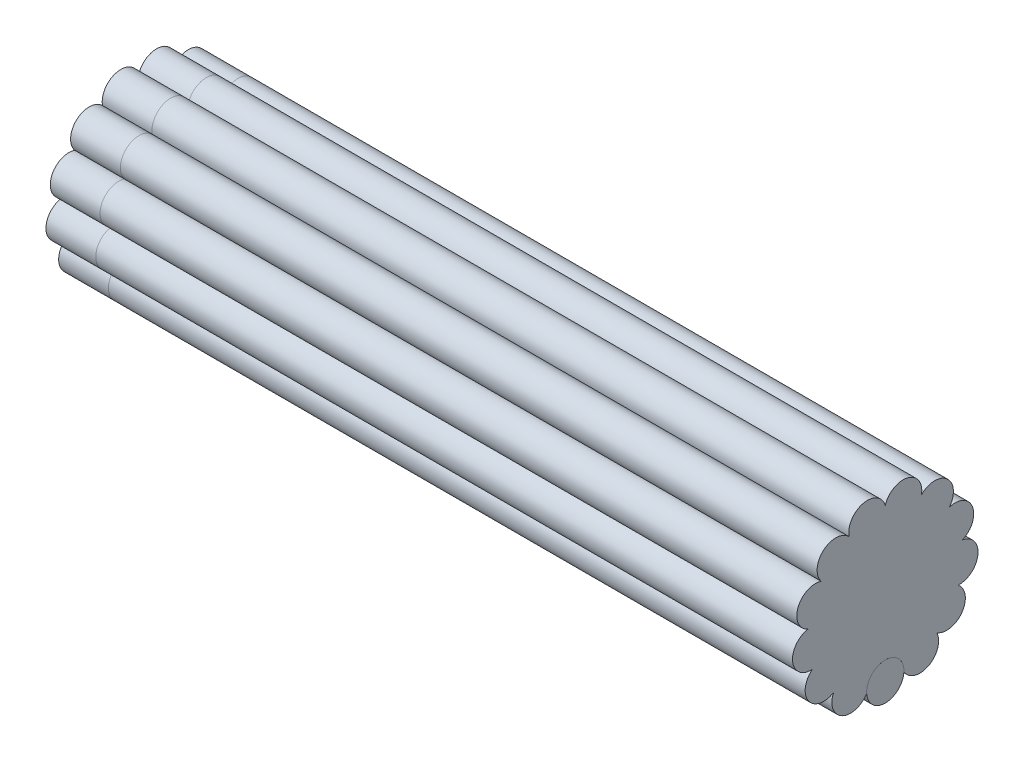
ISO-10303-21;
HEADER;
FILE_DESCRIPTION(('STEP AP214'),'2;1');
FILE_NAME('part.step','',(''),(''),'','','');
FILE_SCHEMA(('AUTOMOTIVE_DESIGN { 1 0 10303 214 1 1 1 1 }'));
ENDSEC;
DATA;
#1=APPLICATION_CONTEXT('core data for automotive mechanical design processes');
#2=APPLICATION_PROTOCOL_DEFINITION('international standard','automotive_design',2000,#1);
#3=PRODUCT_CONTEXT('',#1,'mechanical');
#4=PRODUCT('Part','Part','',(#3));
#5=PRODUCT_RELATED_PRODUCT_CATEGORY('part','',(#4));
#6=PRODUCT_DEFINITION_FORMATION('','',#4);
#7=PRODUCT_DEFINITION_CONTEXT('part definition',#1,'design');
#8=PRODUCT_DEFINITION('design','',#6,#7);
#9=PRODUCT_DEFINITION_SHAPE('','',#8);
#10=(LENGTH_UNIT() NAMED_UNIT(*) SI_UNIT(.MILLI.,.METRE.));
#11=(NAMED_UNIT(*) PLANE_ANGLE_UNIT() SI_UNIT($,.RADIAN.));
#12=(NAMED_UNIT(*) SI_UNIT($,.STERADIAN.) SOLID_ANGLE_UNIT());
#13=UNCERTAINTY_MEASURE_WITH_UNIT(LENGTH_MEASURE(1.E-05),#10,'distance_accuracy_value','');
#14=(GEOMETRIC_REPRESENTATION_CONTEXT(3) GLOBAL_UNCERTAINTY_ASSIGNED_CONTEXT((#13)) GLOBAL_UNIT_ASSIGNED_CONTEXT((#10,
#11,#12)) REPRESENTATION_CONTEXT('',''));
#15=CARTESIAN_POINT('',(0.,0.,0.));
#16=DIRECTION('',(0.,0.,1.));
#17=DIRECTION('',(1.,0.,0.));
#18=AXIS2_PLACEMENT_3D('',#15,#16,#17);
#19=CARTESIAN_POINT('',(-300.,-26.5636807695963,13.9416951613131));
#20=DIRECTION('',(1.,0.,0.));
#21=DIRECTION('',(0.,0.,-1.));
#22=AXIS2_PLACEMENT_3D('',#19,#20,#21);
#23=CYLINDRICAL_SURFACE('',#22,7.50000000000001);
#24=CARTESIAN_POINT('',(-280.,-26.5636807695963,13.9416951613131));
#25=DIRECTION('',(-1.,0.,0.));
#26=DIRECTION('',(0.,0.,1.));
#27=AXIS2_PLACEMENT_3D('',#24,#25,#26);
#28=CIRCLE('',#27,7.50000000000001);
#29=CARTESIAN_POINT('',(-280.,-30.3879587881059,7.48995914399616));
#30=VERTEX_POINT('',#29);
#31=CARTESIAN_POINT('',(-280.,-23.4264436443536,20.7540180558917));
#32=VERTEX_POINT('',#31);
#33=EDGE_CURVE('E168',#30,#32,#28,.T.);
#34=ORIENTED_EDGE('',*,*,#33,.T.);
#35=DIRECTION('',(1.,0.,0.));
#36=VECTOR('',#35,1.);
#37=CARTESIAN_POINT('',(-300.,-23.4264436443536,20.7540180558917));
#38=LINE('',#37,#36);
#39=CARTESIAN_POINT('',(-300.,-23.4264436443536,20.7540180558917));
#40=VERTEX_POINT('',#39);
#41=EDGE_CURVE('E12',#40,#32,#38,.T.);
#42=ORIENTED_EDGE('',*,*,#41,.F.);
#43=CARTESIAN_POINT('',(-300.,-26.5636807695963,13.9416951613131));
#44=DIRECTION('',(-1.,0.,0.));
#45=DIRECTION('',(0.,0.,1.));
#46=AXIS2_PLACEMENT_3D('',#43,#44,#45);
#47=CIRCLE('',#46,7.50000000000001);
#48=CARTESIAN_POINT('',(-300.,-30.3879587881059,7.48995914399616));
#49=VERTEX_POINT('',#48);
#50=EDGE_CURVE('E192',#49,#40,#47,.T.);
#51=ORIENTED_EDGE('',*,*,#50,.F.);
#52=DIRECTION('',(1.,0.,0.));
#53=VECTOR('',#52,1.);
#54=CARTESIAN_POINT('',(-300.,-30.3879587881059,7.48995914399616));
#55=LINE('',#54,#53);
#56=EDGE_CURVE('E164',#49,#30,#55,.T.);
#57=ORIENTED_EDGE('',*,*,#56,.T.);
#58=EDGE_LOOP('',(#34,#42,#51,#57));
#59=FACE_BOUND('',#58,.T.);
#60=ADVANCED_FACE('F42',(#59),#23,.T.);
#61=CARTESIAN_POINT('',(-300.,-17.0419424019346,24.6895159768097));
#62=DIRECTION('',(1.,0.,0.));
#63=DIRECTION('',(0.,0.,-1.));
#64=AXIS2_PLACEMENT_3D('',#61,#62,#63);
#65=CYLINDRICAL_SURFACE('',#64,7.50000000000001);
#66=CARTESIAN_POINT('',(-280.,-17.0419424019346,24.6895159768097));
#67=DIRECTION('',(-1.,0.,0.));
#68=DIRECTION('',(0.,0.,1.));
#69=AXIS2_PLACEMENT_3D('',#66,#67,#68);
#70=CIRCLE('',#69,7.50000000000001);
#71=CARTESIAN_POINT('',(-280.,-11.0982125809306,29.2635815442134));
#72=VERTEX_POINT('',#71);
#73=EDGE_CURVE('E171',#32,#72,#70,.T.);
#74=ORIENTED_EDGE('',*,*,#73,.T.);
#75=DIRECTION('',(1.,0.,0.));
#76=VECTOR('',#75,1.);
#77=CARTESIAN_POINT('',(-300.,-11.0982125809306,29.2635815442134));
#78=LINE('',#77,#76);
#79=CARTESIAN_POINT('',(-300.,-11.0982125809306,29.2635815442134));
#80=VERTEX_POINT('',#79);
#81=EDGE_CURVE('E50',#80,#72,#78,.T.);
#82=ORIENTED_EDGE('',*,*,#81,.F.);
#83=CARTESIAN_POINT('',(-300.,-17.0419424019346,24.6895159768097));
#84=DIRECTION('',(-1.,0.,0.));
#85=DIRECTION('',(0.,0.,1.));
#86=AXIS2_PLACEMENT_3D('',#83,#84,#85);
#87=CIRCLE('',#86,7.50000000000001);
#88=EDGE_CURVE('E116',#40,#80,#87,.T.);
#89=ORIENTED_EDGE('',*,*,#88,.F.);
#90=ORIENTED_EDGE('',*,*,#41,.T.);
#91=EDGE_LOOP('',(#74,#82,#89,#90));
#92=FACE_BOUND('',#91,.T.);
#93=ADVANCED_FACE('F275',(#92),#65,.T.);
#94=CARTESIAN_POINT('',(-300.,-3.61610040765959,29.7812662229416));
#95=DIRECTION('',(1.,0.,0.));
#96=DIRECTION('',(0.,0.,-1.));
#97=AXIS2_PLACEMENT_3D('',#94,#95,#96);
#98=CYLINDRICAL_SURFACE('',#97,7.50000000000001);
#99=CARTESIAN_POINT('',(-280.,-3.61610040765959,29.7812662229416));
#100=DIRECTION('',(-1.,0.,0.));
#101=DIRECTION('',(0.,0.,1.));
#102=AXIS2_PLACEMENT_3D('',#99,#100,#101);
#103=CIRCLE('',#102,7.50000000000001);
#104=CARTESIAN_POINT('',(-280.,3.77248523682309,31.0692111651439));
#105=VERTEX_POINT('',#104);
#106=EDGE_CURVE('E173',#72,#105,#103,.T.);
#107=ORIENTED_EDGE('',*,*,#106,.T.);
#108=DIRECTION('',(1.,0.,0.));
#109=VECTOR('',#108,1.);
#110=CARTESIAN_POINT('',(-300.,3.77248523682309,31.0692111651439));
#111=LINE('',#110,#109);
#112=CARTESIAN_POINT('',(-300.,3.77248523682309,31.0692111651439));
#113=VERTEX_POINT('',#112);
#114=EDGE_CURVE('E214',#113,#105,#111,.T.);
#115=ORIENTED_EDGE('',*,*,#114,.F.);
#116=CARTESIAN_POINT('',(-300.,-3.61610040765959,29.7812662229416));
#117=DIRECTION('',(-1.,0.,0.));
#118=DIRECTION('',(0.,0.,1.));
#119=AXIS2_PLACEMENT_3D('',#116,#117,#118);
#120=CIRCLE('',#119,7.50000000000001);
#121=EDGE_CURVE('E222',#80,#113,#120,.T.);
#122=ORIENTED_EDGE('',*,*,#121,.F.);
#123=ORIENTED_EDGE('',*,*,#81,.T.);
#124=EDGE_LOOP('',(#107,#115,#122,#123));
#125=FACE_BOUND('',#124,.T.);
#126=ADVANCED_FACE('F220',(#125),#98,.T.);
#127=CARTESIAN_POINT('',(-300.,10.6381466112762,28.0504872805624));
#128=DIRECTION('',(1.,0.,0.));
#129=DIRECTION('',(0.,0.,-1.));
#130=AXIS2_PLACEMENT_3D('',#127,#128,#129);
#131=CYLINDRICAL_SURFACE('',#130,7.50000000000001);
#132=CARTESIAN_POINT('',(-280.,10.6381466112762,28.0504872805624));
#133=DIRECTION('',(-1.,0.,0.));
#134=DIRECTION('',(0.,0.,1.));
#135=AXIS2_PLACEMENT_3D('',#132,#133,#134);
#136=CIRCLE('',#135,7.50000000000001);
#137=CARTESIAN_POINT('',(-280.,17.7789521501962,25.7572589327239));
#138=VERTEX_POINT('',#137);
#139=EDGE_CURVE('E175',#105,#138,#136,.T.);
#140=ORIENTED_EDGE('',*,*,#139,.T.);
#141=DIRECTION('',(1.,0.,0.));
#142=VECTOR('',#141,1.);
#143=CARTESIAN_POINT('',(-300.,17.7789521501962,25.7572589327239));
#144=LINE('',#143,#142);
#145=CARTESIAN_POINT('',(-300.,17.7789521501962,25.7572589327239));
#146=VERTEX_POINT('',#145);
#147=EDGE_CURVE('E211',#146,#138,#144,.T.);
#148=ORIENTED_EDGE('',*,*,#147,.F.);
#149=CARTESIAN_POINT('',(-300.,10.6381466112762,28.0504872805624));
#150=DIRECTION('',(-1.,0.,0.));
#151=DIRECTION('',(0.,0.,1.));
#152=AXIS2_PLACEMENT_3D('',#149,#150,#151);
#153=CIRCLE('',#152,7.50000000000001);
#154=EDGE_CURVE('E240',#113,#146,#153,.T.);
#155=ORIENTED_EDGE('',*,*,#154,.F.);
#156=ORIENTED_EDGE('',*,*,#114,.T.);
#157=EDGE_LOOP('',(#140,#148,#155,#156));
#158=FACE_BOUND('',#157,.T.);
#159=ADVANCED_FACE('F231',(#158),#131,.T.);
#160=CARTESIAN_POINT('',(-300.,22.4553224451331,19.8936797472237));
#161=DIRECTION('',(1.,0.,0.));
#162=DIRECTION('',(0.,0.,-1.));
#163=AXIS2_PLACEMENT_3D('',#160,#161,#162);
#164=CYLINDRICAL_SURFACE('',#163,7.50000000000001);
#165=CARTESIAN_POINT('',(-280.,22.4553224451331,19.8936797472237));
#166=DIRECTION('',(-1.,0.,0.));
#167=DIRECTION('',(0.,0.,1.));
#168=AXIS2_PLACEMENT_3D('',#165,#166,#167);
#169=CIRCLE('',#168,7.50000000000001);
#170=CARTESIAN_POINT('',(-280.,27.7124753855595,14.5446290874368));
#171=VERTEX_POINT('',#170);
#172=EDGE_CURVE('E177',#138,#171,#169,.T.);
#173=ORIENTED_EDGE('',*,*,#172,.T.);
#174=DIRECTION('',(1.,0.,0.));
#175=VECTOR('',#174,1.);
#176=CARTESIAN_POINT('',(-300.,27.7124753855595,14.5446290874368));
#177=LINE('',#176,#175);
#178=CARTESIAN_POINT('',(-300.,27.7124753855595,14.5446290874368));
#179=VERTEX_POINT('',#178);
#180=EDGE_CURVE('E208',#179,#171,#177,.T.);
#181=ORIENTED_EDGE('',*,*,#180,.F.);
#182=CARTESIAN_POINT('',(-300.,22.4553224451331,19.8936797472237));
#183=DIRECTION('',(-1.,0.,0.));
#184=DIRECTION('',(0.,0.,1.));
#185=AXIS2_PLACEMENT_3D('',#182,#183,#184);
#186=CIRCLE('',#185,7.50000000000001);
#187=EDGE_CURVE('E237',#146,#179,#186,.T.);
#188=ORIENTED_EDGE('',*,*,#187,.F.);
#189=ORIENTED_EDGE('',*,*,#147,.T.);
#190=EDGE_LOOP('',(#173,#181,#188,#189));
#191=FACE_BOUND('',#190,.T.);
#192=ADVANCED_FACE('F235',(#191),#164,.T.);
#193=CARTESIAN_POINT('',(-300.,29.1282545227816,7.17946992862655));
#194=DIRECTION('',(1.,0.,0.));
#195=DIRECTION('',(0.,0.,-1.));
#196=AXIS2_PLACEMENT_3D('',#193,#194,#195);
#197=CYLINDRICAL_SURFACE('',#196,7.5);
#198=CARTESIAN_POINT('',(-280.,29.1282545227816,7.17946992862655));
#199=DIRECTION('',(-1.,0.,0.));
#200=DIRECTION('',(0.,0.,1.));
#201=AXIS2_PLACEMENT_3D('',#198,#199,#200);
#202=CIRCLE('',#201,7.5);
#203=CARTESIAN_POINT('',(-280.,31.2974044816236,-2.15105711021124E-13));
#204=VERTEX_POINT('',#203);
#205=EDGE_CURVE('E179',#171,#204,#202,.T.);
#206=ORIENTED_EDGE('',*,*,#205,.T.);
#207=DIRECTION('',(1.,0.,0.));
#208=VECTOR('',#207,1.);
#209=CARTESIAN_POINT('',(-300.,31.2974044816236,-2.15105711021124E-13));
#210=LINE('',#209,#208);
#211=CARTESIAN_POINT('',(-300.,31.2974044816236,-2.15105711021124E-13));
#212=VERTEX_POINT('',#211);
#213=EDGE_CURVE('E205',#212,#204,#210,.T.);
#214=ORIENTED_EDGE('',*,*,#213,.F.);
#215=CARTESIAN_POINT('',(-300.,29.1282545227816,7.17946992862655));
#216=DIRECTION('',(-1.,0.,0.));
#217=DIRECTION('',(0.,0.,1.));
#218=AXIS2_PLACEMENT_3D('',#215,#216,#217);
#219=CIRCLE('',#218,7.5);
#220=EDGE_CURVE('E239',#179,#212,#219,.T.);
#221=ORIENTED_EDGE('',*,*,#220,.F.);
#222=ORIENTED_EDGE('',*,*,#180,.T.);
#223=EDGE_LOOP('',(#206,#214,#221,#222));
#224=FACE_BOUND('',#223,.T.);
#225=ADVANCED_FACE('F288',(#224),#197,.T.);
#226=CARTESIAN_POINT('',(-300.,29.1282545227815,-7.17946992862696));
#227=DIRECTION('',(1.,0.,0.));
#228=DIRECTION('',(0.,0.,-1.));
#229=AXIS2_PLACEMENT_3D('',#226,#227,#228);
#230=CYLINDRICAL_SURFACE('',#229,7.50000000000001);
#231=CARTESIAN_POINT('',(-280.,29.1282545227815,-7.17946992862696));
#232=DIRECTION('',(-1.,0.,0.));
#233=DIRECTION('',(0.,0.,1.));
#234=AXIS2_PLACEMENT_3D('',#231,#232,#233);
#235=CIRCLE('',#234,7.50000000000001);
#236=CARTESIAN_POINT('',(-280.,27.7124753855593,-14.5446290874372));
#237=VERTEX_POINT('',#236);
#238=EDGE_CURVE('E181',#204,#237,#235,.T.);
#239=ORIENTED_EDGE('',*,*,#238,.T.);
#240=DIRECTION('',(1.,0.,0.));
#241=VECTOR('',#240,1.);
#242=CARTESIAN_POINT('',(-300.,27.7124753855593,-14.5446290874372));
#243=LINE('',#242,#241);
#244=CARTESIAN_POINT('',(-300.,27.7124753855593,-14.5446290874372));
#245=VERTEX_POINT('',#244);
#246=EDGE_CURVE('E202',#245,#237,#243,.T.);
#247=ORIENTED_EDGE('',*,*,#246,.F.);
#248=CARTESIAN_POINT('',(-300.,29.1282545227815,-7.17946992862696));
#249=DIRECTION('',(-1.,0.,0.));
#250=DIRECTION('',(0.,0.,1.));
#251=AXIS2_PLACEMENT_3D('',#248,#249,#250);
#252=CIRCLE('',#251,7.50000000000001);
#253=EDGE_CURVE('E242',#212,#245,#252,.T.);
#254=ORIENTED_EDGE('',*,*,#253,.F.);
#255=ORIENTED_EDGE('',*,*,#213,.T.);
#256=EDGE_LOOP('',(#239,#247,#254,#255));
#257=FACE_BOUND('',#256,.T.);
#258=ADVANCED_FACE('F291',(#257),#230,.T.);
#259=CARTESIAN_POINT('',(-300.,22.4553224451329,-19.893679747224));
#260=DIRECTION('',(1.,0.,0.));
#261=DIRECTION('',(0.,0.,-1.));
#262=AXIS2_PLACEMENT_3D('',#259,#260,#261);
#263=CYLINDRICAL_SURFACE('',#262,7.50000000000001);
#264=CARTESIAN_POINT('',(-280.,22.4553224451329,-19.893679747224));
#265=DIRECTION('',(-1.,0.,0.));
#266=DIRECTION('',(0.,0.,1.));
#267=AXIS2_PLACEMENT_3D('',#264,#265,#266);
#268=CIRCLE('',#267,7.50000000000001);
#269=CARTESIAN_POINT('',(-280.,17.7789521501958,-25.7572589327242));
#270=VERTEX_POINT('',#269);
#271=EDGE_CURVE('E183',#237,#270,#268,.T.);
#272=ORIENTED_EDGE('',*,*,#271,.T.);
#273=DIRECTION('',(1.,0.,0.));
#274=VECTOR('',#273,1.);
#275=CARTESIAN_POINT('',(-300.,17.7789521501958,-25.7572589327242));
#276=LINE('',#275,#274);
#277=CARTESIAN_POINT('',(-300.,17.7789521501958,-25.7572589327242));
#278=VERTEX_POINT('',#277);
#279=EDGE_CURVE('E199',#278,#270,#276,.T.);
#280=ORIENTED_EDGE('',*,*,#279,.F.);
#281=CARTESIAN_POINT('',(-300.,22.4553224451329,-19.893679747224));
#282=DIRECTION('',(-1.,0.,0.));
#283=DIRECTION('',(0.,0.,1.));
#284=AXIS2_PLACEMENT_3D('',#281,#282,#283);
#285=CIRCLE('',#284,7.50000000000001);
#286=EDGE_CURVE('E248',#245,#278,#285,.T.);
#287=ORIENTED_EDGE('',*,*,#286,.F.);
#288=ORIENTED_EDGE('',*,*,#246,.T.);
#289=EDGE_LOOP('',(#272,#280,#287,#288));
#290=FACE_BOUND('',#289,.T.);
#291=ADVANCED_FACE('F295',(#290),#263,.T.);
#292=CARTESIAN_POINT('',(-300.,10.6381466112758,-28.0504872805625));
#293=DIRECTION('',(1.,0.,0.));
#294=DIRECTION('',(0.,0.,-1.));
#295=AXIS2_PLACEMENT_3D('',#292,#293,#294);
#296=CYLINDRICAL_SURFACE('',#295,7.49999999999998);
#297=CARTESIAN_POINT('',(-280.,10.6381466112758,-28.0504872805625));
#298=DIRECTION('',(-1.,0.,0.));
#299=DIRECTION('',(0.,0.,1.));
#300=AXIS2_PLACEMENT_3D('',#297,#298,#299);
#301=CIRCLE('',#300,7.49999999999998);
#302=CARTESIAN_POINT('',(-280.,3.77248523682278,-31.069211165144));
#303=VERTEX_POINT('',#302);
#304=EDGE_CURVE('E185',#270,#303,#301,.T.);
#305=ORIENTED_EDGE('',*,*,#304,.T.);
#306=DIRECTION('',(1.,0.,0.));
#307=VECTOR('',#306,1.);
#308=CARTESIAN_POINT('',(-300.,3.77248523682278,-31.069211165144));
#309=LINE('',#308,#307);
#310=CARTESIAN_POINT('',(-300.,3.77248523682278,-31.069211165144));
#311=VERTEX_POINT('',#310);
#312=EDGE_CURVE('E196',#311,#303,#309,.T.);
#313=ORIENTED_EDGE('',*,*,#312,.F.);
#314=CARTESIAN_POINT('',(-300.,10.6381466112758,-28.0504872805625));
#315=DIRECTION('',(-1.,0.,0.));
#316=DIRECTION('',(0.,0.,1.));
#317=AXIS2_PLACEMENT_3D('',#314,#315,#316);
#318=CIRCLE('',#317,7.49999999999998);
#319=EDGE_CURVE('E250',#278,#311,#318,.T.);
#320=ORIENTED_EDGE('',*,*,#319,.F.);
#321=ORIENTED_EDGE('',*,*,#279,.T.);
#322=EDGE_LOOP('',(#305,#313,#320,#321));
#323=FACE_BOUND('',#322,.T.);
#324=ADVANCED_FACE('F256',(#323),#296,.T.);
#325=CARTESIAN_POINT('',(-300.,-3.61610040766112,-29.7812662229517));
#326=DIRECTION('',(1.,0.,0.));
#327=DIRECTION('',(0.,0.,-1.));
#328=AXIS2_PLACEMENT_3D('',#325,#326,#327);
#329=CYLINDRICAL_SURFACE('',#328,7.49999999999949);
#330=CARTESIAN_POINT('',(-280.,-3.61610040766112,-29.7812662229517));
#331=DIRECTION('',(-1.,0.,0.));
#332=DIRECTION('',(0.,0.,1.));
#333=AXIS2_PLACEMENT_3D('',#330,#331,#332);
#334=CIRCLE('',#333,7.49999999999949);
#335=CARTESIAN_POINT('',(-280.,-11.098212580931,-29.2635815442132));
#336=VERTEX_POINT('',#335);
#337=EDGE_CURVE('E187',#303,#336,#334,.T.);
#338=ORIENTED_EDGE('',*,*,#337,.T.);
#339=DIRECTION('',(1.,0.,0.));
#340=VECTOR('',#339,1.);
#341=CARTESIAN_POINT('',(-300.,-11.098212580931,-29.2635815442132));
#342=LINE('',#341,#340);
#343=CARTESIAN_POINT('',(-300.,-11.098212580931,-29.2635815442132));
#344=VERTEX_POINT('',#343);
#345=EDGE_CURVE('E159',#344,#336,#342,.T.);
#346=ORIENTED_EDGE('',*,*,#345,.F.);
#347=CARTESIAN_POINT('',(-300.,-3.61610040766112,-29.7812662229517));
#348=DIRECTION('',(-1.,0.,0.));
#349=DIRECTION('',(0.,0.,1.));
#350=AXIS2_PLACEMENT_3D('',#347,#348,#349);
#351=CIRCLE('',#350,7.49999999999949);
#352=EDGE_CURVE('E150',#311,#344,#351,.T.);
#353=ORIENTED_EDGE('',*,*,#352,.F.);
#354=ORIENTED_EDGE('',*,*,#312,.T.);
#355=EDGE_LOOP('',(#338,#346,#353,#354));
#356=FACE_BOUND('',#355,.T.);
#357=ADVANCED_FACE('F260',(#356),#329,.T.);
#358=CARTESIAN_POINT('',(-300.,-17.041942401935,-24.6895159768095));
#359=DIRECTION('',(1.,0.,0.));
#360=DIRECTION('',(0.,0.,-1.));
#361=AXIS2_PLACEMENT_3D('',#358,#359,#360);
#362=CYLINDRICAL_SURFACE('',#361,7.50000000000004);
#363=CARTESIAN_POINT('',(-280.,-17.041942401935,-24.6895159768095));
#364=DIRECTION('',(-1.,0.,0.));
#365=DIRECTION('',(0.,0.,1.));
#366=AXIS2_PLACEMENT_3D('',#363,#364,#365);
#367=CIRCLE('',#366,7.50000000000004);
#368=CARTESIAN_POINT('',(-280.,-23.4264436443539,-20.7540180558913));
#369=VERTEX_POINT('',#368);
#370=EDGE_CURVE('E158',#336,#369,#367,.T.);
#371=ORIENTED_EDGE('',*,*,#370,.T.);
#372=DIRECTION('',(1.,0.,0.));
#373=VECTOR('',#372,1.);
#374=CARTESIAN_POINT('',(-300.,-23.4264436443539,-20.7540180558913));
#375=LINE('',#374,#373);
#376=CARTESIAN_POINT('',(-300.,-23.4264436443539,-20.7540180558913));
#377=VERTEX_POINT('',#376);
#378=EDGE_CURVE('E155',#377,#369,#375,.T.);
#379=ORIENTED_EDGE('',*,*,#378,.F.);
#380=CARTESIAN_POINT('',(-300.,-17.041942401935,-24.6895159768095));
#381=DIRECTION('',(-1.,0.,0.));
#382=DIRECTION('',(0.,0.,1.));
#383=AXIS2_PLACEMENT_3D('',#380,#381,#382);
#384=CIRCLE('',#383,7.50000000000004);
#385=EDGE_CURVE('E144',#344,#377,#384,.T.);
#386=ORIENTED_EDGE('',*,*,#385,.F.);
#387=ORIENTED_EDGE('',*,*,#345,.T.);
#388=EDGE_LOOP('',(#371,#379,#386,#387));
#389=FACE_BOUND('',#388,.T.);
#390=ADVANCED_FACE('F156',(#389),#362,.T.);
#391=CARTESIAN_POINT('',(-300.,-26.5636807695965,-13.9416951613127));
#392=DIRECTION('',(1.,0.,0.));
#393=DIRECTION('',(0.,0.,-1.));
#394=AXIS2_PLACEMENT_3D('',#391,#392,#393);
#395=CYLINDRICAL_SURFACE('',#394,7.50000000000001);
#396=CARTESIAN_POINT('',(-280.,-26.5636807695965,-13.9416951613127));
#397=DIRECTION('',(-1.,0.,0.));
#398=DIRECTION('',(0.,0.,1.));
#399=AXIS2_PLACEMENT_3D('',#396,#397,#398);
#400=CIRCLE('',#399,7.50000000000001);
#401=CARTESIAN_POINT('',(-280.,-30.3879587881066,-7.48995914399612));
#402=VERTEX_POINT('',#401);
#403=EDGE_CURVE('E102',#369,#402,#400,.T.);
#404=ORIENTED_EDGE('',*,*,#403,.T.);
#405=DIRECTION('',(1.,0.,0.));
#406=VECTOR('',#405,1.);
#407=CARTESIAN_POINT('',(-300.,-30.3879587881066,-7.48995914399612));
#408=LINE('',#407,#406);
#409=CARTESIAN_POINT('',(-300.,-30.3879587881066,-7.48995914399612));
#410=VERTEX_POINT('',#409);
#411=EDGE_CURVE('E160',#410,#402,#408,.T.);
#412=ORIENTED_EDGE('',*,*,#411,.F.);
#413=CARTESIAN_POINT('',(-300.,-26.5636807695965,-13.9416951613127));
#414=DIRECTION('',(-1.,0.,0.));
#415=DIRECTION('',(0.,0.,1.));
#416=AXIS2_PLACEMENT_3D('',#413,#414,#415);
#417=CIRCLE('',#416,7.50000000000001);
#418=EDGE_CURVE('E148',#377,#410,#417,.T.);
#419=ORIENTED_EDGE('',*,*,#418,.F.);
#420=ORIENTED_EDGE('',*,*,#378,.T.);
#421=EDGE_LOOP('',(#404,#412,#419,#420));
#422=FACE_BOUND('',#421,.T.);
#423=ADVANCED_FACE('F162',(#422),#395,.T.);
#424=CARTESIAN_POINT('',(-300.,-30.,0.));
#425=DIRECTION('',(1.,0.,0.));
#426=DIRECTION('',(0.,0.,-1.));
#427=AXIS2_PLACEMENT_3D('',#424,#425,#426);
#428=CYLINDRICAL_SURFACE('',#427,7.50000000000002);
#429=CARTESIAN_POINT('',(-280.,-30.,0.));
#430=DIRECTION('',(-1.,0.,0.));
#431=DIRECTION('',(0.,0.,1.));
#432=AXIS2_PLACEMENT_3D('',#429,#430,#431);
#433=CIRCLE('',#432,7.50000000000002);
#434=EDGE_CURVE('E108',#402,#30,#433,.T.);
#435=ORIENTED_EDGE('',*,*,#434,.T.);
#436=ORIENTED_EDGE('',*,*,#56,.F.);
#437=CARTESIAN_POINT('',(-300.,-30.,0.));
#438=DIRECTION('',(-1.,0.,0.));
#439=DIRECTION('',(0.,0.,1.));
#440=AXIS2_PLACEMENT_3D('',#437,#438,#439);
#441=CIRCLE('',#440,7.50000000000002);
#442=EDGE_CURVE('E58',#410,#49,#441,.T.);
#443=ORIENTED_EDGE('',*,*,#442,.F.);
#444=ORIENTED_EDGE('',*,*,#411,.T.);
#445=EDGE_LOOP('',(#435,#436,#443,#444));
#446=FACE_BOUND('',#445,.T.);
#447=ADVANCED_FACE('F264',(#446),#428,.T.);
#448=CARTESIAN_POINT('',(-300.,-21.8028115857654,19.3156055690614));
#449=DIRECTION('',(-1.,0.,0.));
#450=DIRECTION('',(0.,0.,1.));
#451=AXIS2_PLACEMENT_3D('',#448,#449,#450);
#452=PLANE('',#451);
#453=ORIENTED_EDGE('',*,*,#50,.T.);
#454=ORIENTED_EDGE('',*,*,#88,.T.);
#455=ORIENTED_EDGE('',*,*,#121,.T.);
#456=ORIENTED_EDGE('',*,*,#154,.T.);
#457=ORIENTED_EDGE('',*,*,#187,.T.);
#458=ORIENTED_EDGE('',*,*,#220,.T.);
#459=ORIENTED_EDGE('',*,*,#253,.T.);
#460=ORIENTED_EDGE('',*,*,#286,.T.);
#461=ORIENTED_EDGE('',*,*,#319,.T.);
#462=ORIENTED_EDGE('',*,*,#352,.T.);
#463=ORIENTED_EDGE('',*,*,#385,.T.);
#464=ORIENTED_EDGE('',*,*,#418,.T.);
#465=ORIENTED_EDGE('',*,*,#442,.T.);
#466=EDGE_LOOP('',(#453,#454,#455,#456,#457,#458,#459,#460,#461,#462,#463,#464,#465));
#467=FACE_BOUND('',#466,.T.);
#468=ADVANCED_FACE('F146',(#467),#452,.T.);
#469=CARTESIAN_POINT('',(-280.,-21.8028115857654,19.3156055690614));
#470=DIRECTION('',(-1.,0.,0.));
#471=DIRECTION('',(0.,0.,1.));
#472=AXIS2_PLACEMENT_3D('',#469,#470,#471);
#473=PLANE('',#472);
#474=ORIENTED_EDGE('',*,*,#33,.F.);
#475=ORIENTED_EDGE('',*,*,#434,.F.);
#476=ORIENTED_EDGE('',*,*,#403,.F.);
#477=ORIENTED_EDGE('',*,*,#370,.F.);
#478=ORIENTED_EDGE('',*,*,#337,.F.);
#479=ORIENTED_EDGE('',*,*,#304,.F.);
#480=ORIENTED_EDGE('',*,*,#271,.F.);
#481=ORIENTED_EDGE('',*,*,#238,.F.);
#482=ORIENTED_EDGE('',*,*,#205,.F.);
#483=ORIENTED_EDGE('',*,*,#172,.F.);
#484=ORIENTED_EDGE('',*,*,#139,.F.);
#485=ORIENTED_EDGE('',*,*,#106,.F.);
#486=ORIENTED_EDGE('',*,*,#73,.F.);
#487=EDGE_LOOP('',(#474,#475,#476,#477,#478,#479,#480,#481,#482,#483,#484,#485,#486));
#488=FACE_BOUND('',#487,.T.);
#489=ADVANCED_FACE('F226',(#488),#473,.F.);
#490=CLOSED_SHELL('',(#60,#93,#126,#159,#192,#225,#258,#291,#324,#357,#390,#423,#447,#468,#489));
#491=MANIFOLD_SOLID_BREP('B2',#490);
#492=CARTESIAN_POINT('',(-280.,-30.,0.));
#493=DIRECTION('',(1.,0.,0.));
#494=DIRECTION('',(0.,0.,-1.));
#495=AXIS2_PLACEMENT_3D('',#492,#493,#494);
#496=CYLINDRICAL_SURFACE('',#495,7.5);
#497=CARTESIAN_POINT('',(-280.,-30.,0.));
#498=DIRECTION('',(1.,0.,0.));
#499=DIRECTION('',(0.,0.,-1.));
#500=AXIS2_PLACEMENT_3D('',#497,#498,#499);
#501=CIRCLE('',#500,7.5);
#502=CARTESIAN_POINT('',(-280.,-30.,-7.5));
#503=VERTEX_POINT('',#502);
#504=EDGE_CURVE('E41',#503,#503,#501,.T.);
#505=ORIENTED_EDGE('',*,*,#504,.T.);
#506=EDGE_LOOP('',(#505));
#507=FACE_BOUND('',#506,.T.);
#508=CARTESIAN_POINT('',(0.,-30.,0.));
#509=DIRECTION('',(1.,0.,0.));
#510=DIRECTION('',(0.,0.,-1.));
#511=AXIS2_PLACEMENT_3D('',#508,#509,#510);
#512=CIRCLE('',#511,7.5);
#513=CARTESIAN_POINT('',(0.,-30.,-7.5));
#514=VERTEX_POINT('',#513);
#515=EDGE_CURVE('E412',#514,#514,#512,.T.);
#516=ORIENTED_EDGE('',*,*,#515,.F.);
#517=EDGE_LOOP('',(#516));
#518=FACE_BOUND('',#517,.T.);
#519=ADVANCED_FACE('F409',(#507,#518),#496,.T.);
#520=CARTESIAN_POINT('',(-280.,-30.,0.));
#521=DIRECTION('',(1.,0.,0.));
#522=DIRECTION('',(0.,0.,-1.));
#523=AXIS2_PLACEMENT_3D('',#520,#521,#522);
#524=PLANE('',#523);
#525=ORIENTED_EDGE('',*,*,#504,.F.);
#526=EDGE_LOOP('',(#525));
#527=FACE_BOUND('',#526,.T.);
#528=ADVANCED_FACE('F424',(#527),#524,.F.);
#529=CARTESIAN_POINT('',(0.,-30.,0.));
#530=DIRECTION('',(1.,0.,0.));
#531=DIRECTION('',(0.,0.,-1.));
#532=AXIS2_PLACEMENT_3D('',#529,#530,#531);
#533=PLANE('',#532);
#534=ORIENTED_EDGE('',*,*,#515,.T.);
#535=EDGE_LOOP('',(#534));
#536=FACE_BOUND('',#535,.T.);
#537=ADVANCED_FACE('F421',(#536),#533,.T.);
#538=CLOSED_SHELL('',(#519,#528,#537));
#539=MANIFOLD_SOLID_BREP('B6',#538);
#540=CARTESIAN_POINT('',(-280.,-26.5636807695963,13.9416951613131));
#541=DIRECTION('',(1.,0.,0.));
#542=DIRECTION('',(0.,0.,-1.));
#543=AXIS2_PLACEMENT_3D('',#540,#541,#542);
#544=CYLINDRICAL_SURFACE('',#543,7.50000000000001);
#545=CARTESIAN_POINT('',(0.,-26.5636807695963,13.9416951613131));
#546=DIRECTION('',(1.,0.,0.));
#547=DIRECTION('',(0.,0.,-1.));
#548=AXIS2_PLACEMENT_3D('',#545,#546,#547);
#549=CIRCLE('',#548,7.50000000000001);
#550=CARTESIAN_POINT('',(0.,-23.4264436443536,20.7540180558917));
#551=VERTEX_POINT('',#550);
#552=CARTESIAN_POINT('',(0.,-30.3879587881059,7.48995914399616));
#553=VERTEX_POINT('',#552);
#554=EDGE_CURVE('E577',#551,#553,#549,.T.);
#555=ORIENTED_EDGE('',*,*,#554,.F.);
#556=DIRECTION('',(1.,0.,0.));
#557=VECTOR('',#556,1.);
#558=CARTESIAN_POINT('',(-280.,-23.4264436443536,20.7540180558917));
#559=LINE('',#558,#557);
#560=CARTESIAN_POINT('',(-280.,-23.4264436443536,20.7540180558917));
#561=VERTEX_POINT('',#560);
#562=EDGE_CURVE('E407',#561,#551,#559,.T.);
#563=ORIENTED_EDGE('',*,*,#562,.F.);
#564=CARTESIAN_POINT('',(-280.,-26.5636807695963,13.9416951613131));
#565=DIRECTION('',(1.,0.,0.));
#566=DIRECTION('',(0.,0.,-1.));
#567=AXIS2_PLACEMENT_3D('',#564,#565,#566);
#568=CIRCLE('',#567,7.50000000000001);
#569=CARTESIAN_POINT('',(-280.,-30.3879587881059,7.48995914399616));
#570=VERTEX_POINT('',#569);
#571=EDGE_CURVE('E612',#561,#570,#568,.T.);
#572=ORIENTED_EDGE('',*,*,#571,.T.);
#573=DIRECTION('',(1.,0.,0.));
#574=VECTOR('',#573,1.);
#575=CARTESIAN_POINT('',(-280.,-30.3879587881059,7.48995914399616));
#576=LINE('',#575,#574);
#577=EDGE_CURVE('E453',#570,#553,#576,.T.);
#578=ORIENTED_EDGE('',*,*,#577,.T.);
#579=EDGE_LOOP('',(#555,#563,#572,#578));
#580=FACE_BOUND('',#579,.T.);
#581=ADVANCED_FACE('F450',(#580),#544,.T.);
#582=CARTESIAN_POINT('',(-280.,-17.0419424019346,24.6895159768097));
#583=DIRECTION('',(1.,0.,0.));
#584=DIRECTION('',(0.,0.,-1.));
#585=AXIS2_PLACEMENT_3D('',#582,#583,#584);
#586=CYLINDRICAL_SURFACE('',#585,7.50000000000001);
#587=CARTESIAN_POINT('',(0.,-17.0419424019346,24.6895159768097));
#588=DIRECTION('',(1.,0.,0.));
#589=DIRECTION('',(0.,0.,-1.));
#590=AXIS2_PLACEMENT_3D('',#587,#588,#589);
#591=CIRCLE('',#590,7.50000000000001);
#592=CARTESIAN_POINT('',(0.,-11.0982125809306,29.2635815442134));
#593=VERTEX_POINT('',#592);
#594=EDGE_CURVE('E610',#593,#551,#591,.T.);
#595=ORIENTED_EDGE('',*,*,#594,.F.);
#596=DIRECTION('',(1.,0.,0.));
#597=VECTOR('',#596,1.);
#598=CARTESIAN_POINT('',(-280.,-11.0982125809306,29.2635815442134));
#599=LINE('',#598,#597);
#600=CARTESIAN_POINT('',(-280.,-11.0982125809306,29.2635815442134));
#601=VERTEX_POINT('',#600);
#602=EDGE_CURVE('E459',#601,#593,#599,.T.);
#603=ORIENTED_EDGE('',*,*,#602,.F.);
#604=CARTESIAN_POINT('',(-280.,-17.0419424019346,24.6895159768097));
#605=DIRECTION('',(1.,0.,0.));
#606=DIRECTION('',(0.,0.,-1.));
#607=AXIS2_PLACEMENT_3D('',#604,#605,#606);
#608=CIRCLE('',#607,7.50000000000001);
#609=EDGE_CURVE('E567',#601,#561,#608,.T.);
#610=ORIENTED_EDGE('',*,*,#609,.T.);
#611=ORIENTED_EDGE('',*,*,#562,.T.);
#612=EDGE_LOOP('',(#595,#603,#610,#611));
#613=FACE_BOUND('',#612,.T.);
#614=ADVANCED_FACE('F634',(#613),#586,.T.);
#615=CARTESIAN_POINT('',(-280.,-3.61610040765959,29.7812662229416));
#616=DIRECTION('',(1.,0.,0.));
#617=DIRECTION('',(0.,0.,-1.));
#618=AXIS2_PLACEMENT_3D('',#615,#616,#617);
#619=CYLINDRICAL_SURFACE('',#618,7.50000000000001);
#620=CARTESIAN_POINT('',(0.,-3.61610040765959,29.7812662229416));
#621=DIRECTION('',(1.,0.,0.));
#622=DIRECTION('',(0.,0.,-1.));
#623=AXIS2_PLACEMENT_3D('',#620,#621,#622);
#624=CIRCLE('',#623,7.50000000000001);
#625=CARTESIAN_POINT('',(0.,3.7724852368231,31.0692111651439));
#626=VERTEX_POINT('',#625);
#627=EDGE_CURVE('E554',#626,#593,#624,.T.);
#628=ORIENTED_EDGE('',*,*,#627,.F.);
#629=DIRECTION('',(1.,0.,0.));
#630=VECTOR('',#629,1.);
#631=CARTESIAN_POINT('',(-280.,3.7724852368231,31.0692111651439));
#632=LINE('',#631,#630);
#633=CARTESIAN_POINT('',(-280.,3.7724852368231,31.0692111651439));
#634=VERTEX_POINT('',#633);
#635=EDGE_CURVE('E549',#634,#626,#632,.T.);
#636=ORIENTED_EDGE('',*,*,#635,.F.);
#637=CARTESIAN_POINT('',(-280.,-3.61610040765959,29.7812662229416));
#638=DIRECTION('',(1.,0.,0.));
#639=DIRECTION('',(0.,0.,-1.));
#640=AXIS2_PLACEMENT_3D('',#637,#638,#639);
#641=CIRCLE('',#640,7.50000000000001);
#642=EDGE_CURVE('E552',#634,#601,#641,.T.);
#643=ORIENTED_EDGE('',*,*,#642,.T.);
#644=ORIENTED_EDGE('',*,*,#602,.T.);
#645=EDGE_LOOP('',(#628,#636,#643,#644));
#646=FACE_BOUND('',#645,.T.);
#647=ADVANCED_FACE('F551',(#646),#619,.T.);
#648=CARTESIAN_POINT('',(-280.,10.6381466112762,28.0504872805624));
#649=DIRECTION('',(1.,0.,0.));
#650=DIRECTION('',(0.,0.,-1.));
#651=AXIS2_PLACEMENT_3D('',#648,#649,#650);
#652=CYLINDRICAL_SURFACE('',#651,7.50000000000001);
#653=CARTESIAN_POINT('',(0.,10.6381466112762,28.0504872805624));
#654=DIRECTION('',(1.,0.,0.));
#655=DIRECTION('',(0.,0.,-1.));
#656=AXIS2_PLACEMENT_3D('',#653,#654,#655);
#657=CIRCLE('',#656,7.50000000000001);
#658=CARTESIAN_POINT('',(0.,17.7789521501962,25.757258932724));
#659=VERTEX_POINT('',#658);
#660=EDGE_CURVE('E607',#659,#626,#657,.T.);
#661=ORIENTED_EDGE('',*,*,#660,.F.);
#662=DIRECTION('',(1.,0.,0.));
#663=VECTOR('',#662,1.);
#664=CARTESIAN_POINT('',(-280.,17.7789521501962,25.757258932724));
#665=LINE('',#664,#663);
#666=CARTESIAN_POINT('',(-280.,17.7789521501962,25.757258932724));
#667=VERTEX_POINT('',#666);
#668=EDGE_CURVE('E559',#667,#659,#665,.T.);
#669=ORIENTED_EDGE('',*,*,#668,.F.);
#670=CARTESIAN_POINT('',(-280.,10.6381466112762,28.0504872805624));
#671=DIRECTION('',(1.,0.,0.));
#672=DIRECTION('',(0.,0.,-1.));
#673=AXIS2_PLACEMENT_3D('',#670,#671,#672);
#674=CIRCLE('',#673,7.50000000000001);
#675=EDGE_CURVE('E565',#667,#634,#674,.T.);
#676=ORIENTED_EDGE('',*,*,#675,.T.);
#677=ORIENTED_EDGE('',*,*,#635,.T.);
#678=EDGE_LOOP('',(#661,#669,#676,#677));
#679=FACE_BOUND('',#678,.T.);
#680=ADVANCED_FACE('F569',(#679),#652,.T.);
#681=CARTESIAN_POINT('',(-280.,22.4553224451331,19.8936797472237));
#682=DIRECTION('',(1.,0.,0.));
#683=DIRECTION('',(0.,0.,-1.));
#684=AXIS2_PLACEMENT_3D('',#681,#682,#683);
#685=CYLINDRICAL_SURFACE('',#684,7.50000000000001);
#686=CARTESIAN_POINT('',(0.,22.4553224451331,19.8936797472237));
#687=DIRECTION('',(1.,0.,0.));
#688=DIRECTION('',(0.,0.,-1.));
#689=AXIS2_PLACEMENT_3D('',#686,#687,#688);
#690=CIRCLE('',#689,7.50000000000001);
#691=CARTESIAN_POINT('',(0.,27.7124753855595,14.5446290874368));
#692=VERTEX_POINT('',#691);
#693=EDGE_CURVE('E604',#692,#659,#690,.T.);
#694=ORIENTED_EDGE('',*,*,#693,.F.);
#695=DIRECTION('',(1.,0.,0.));
#696=VECTOR('',#695,1.);
#697=CARTESIAN_POINT('',(-280.,27.7124753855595,14.5446290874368));
#698=LINE('',#697,#696);
#699=CARTESIAN_POINT('',(-280.,27.7124753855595,14.5446290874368));
#700=VERTEX_POINT('',#699);
#701=EDGE_CURVE('E616',#700,#692,#698,.T.);
#702=ORIENTED_EDGE('',*,*,#701,.F.);
#703=CARTESIAN_POINT('',(-280.,22.4553224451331,19.8936797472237));
#704=DIRECTION('',(1.,0.,0.));
#705=DIRECTION('',(0.,0.,-1.));
#706=AXIS2_PLACEMENT_3D('',#703,#704,#705);
#707=CIRCLE('',#706,7.50000000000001);
#708=EDGE_CURVE('E570',#700,#667,#707,.T.);
#709=ORIENTED_EDGE('',*,*,#708,.T.);
#710=ORIENTED_EDGE('',*,*,#668,.T.);
#711=EDGE_LOOP('',(#694,#702,#709,#710));
#712=FACE_BOUND('',#711,.T.);
#713=ADVANCED_FACE('F647',(#712),#685,.T.);
#714=CARTESIAN_POINT('',(-280.,29.1282545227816,7.17946992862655));
#715=DIRECTION('',(1.,0.,0.));
#716=DIRECTION('',(0.,0.,-1.));
#717=AXIS2_PLACEMENT_3D('',#714,#715,#716);
#718=CYLINDRICAL_SURFACE('',#717,7.5);
#719=CARTESIAN_POINT('',(0.,29.1282545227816,7.17946992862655));
#720=DIRECTION('',(1.,0.,0.));
#721=DIRECTION('',(0.,0.,-1.));
#722=AXIS2_PLACEMENT_3D('',#719,#720,#721);
#723=CIRCLE('',#722,7.5);
#724=CARTESIAN_POINT('',(0.,31.2974044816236,-2.14238349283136E-13));
#725=VERTEX_POINT('',#724);
#726=EDGE_CURVE('E601',#725,#692,#723,.T.);
#727=ORIENTED_EDGE('',*,*,#726,.F.);
#728=DIRECTION('',(1.,0.,0.));
#729=VECTOR('',#728,1.);
#730=CARTESIAN_POINT('',(-280.,31.2974044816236,-2.14238349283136E-13));
#731=LINE('',#730,#729);
#732=CARTESIAN_POINT('',(-280.,31.2974044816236,-2.14238349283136E-13));
#733=VERTEX_POINT('',#732);
#734=EDGE_CURVE('E618',#733,#725,#731,.T.);
#735=ORIENTED_EDGE('',*,*,#734,.F.);
#736=CARTESIAN_POINT('',(-280.,29.1282545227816,7.17946992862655));
#737=DIRECTION('',(1.,0.,0.));
#738=DIRECTION('',(0.,0.,-1.));
#739=AXIS2_PLACEMENT_3D('',#736,#737,#738);
#740=CIRCLE('',#739,7.5);
#741=EDGE_CURVE('E572',#733,#700,#740,.T.);
#742=ORIENTED_EDGE('',*,*,#741,.T.);
#743=ORIENTED_EDGE('',*,*,#701,.T.);
#744=EDGE_LOOP('',(#727,#735,#742,#743));
#745=FACE_BOUND('',#744,.T.);
#746=ADVANCED_FACE('F650',(#745),#718,.T.);
#747=CARTESIAN_POINT('',(-280.,29.1282545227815,-7.17946992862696));
#748=DIRECTION('',(1.,0.,0.));
#749=DIRECTION('',(0.,0.,-1.));
#750=AXIS2_PLACEMENT_3D('',#747,#748,#749);
#751=CYLINDRICAL_SURFACE('',#750,7.50000000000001);
#752=CARTESIAN_POINT('',(0.,29.1282545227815,-7.17946992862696));
#753=DIRECTION('',(1.,0.,0.));
#754=DIRECTION('',(0.,0.,-1.));
#755=AXIS2_PLACEMENT_3D('',#752,#753,#754);
#756=CIRCLE('',#755,7.50000000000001);
#757=CARTESIAN_POINT('',(0.,27.7124753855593,-14.5446290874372));
#758=VERTEX_POINT('',#757);
#759=EDGE_CURVE('E598',#758,#725,#756,.T.);
#760=ORIENTED_EDGE('',*,*,#759,.F.);
#761=DIRECTION('',(1.,0.,0.));
#762=VECTOR('',#761,1.);
#763=CARTESIAN_POINT('',(-280.,27.7124753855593,-14.5446290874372));
#764=LINE('',#763,#762);
#765=CARTESIAN_POINT('',(-280.,27.7124753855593,-14.5446290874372));
#766=VERTEX_POINT('',#765);
#767=EDGE_CURVE('E620',#766,#758,#764,.T.);
#768=ORIENTED_EDGE('',*,*,#767,.F.);
#769=CARTESIAN_POINT('',(-280.,29.1282545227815,-7.17946992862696));
#770=DIRECTION('',(1.,0.,0.));
#771=DIRECTION('',(0.,0.,-1.));
#772=AXIS2_PLACEMENT_3D('',#769,#770,#771);
#773=CIRCLE('',#772,7.50000000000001);
#774=EDGE_CURVE('E790',#766,#733,#773,.T.);
#775=ORIENTED_EDGE('',*,*,#774,.T.);
#776=ORIENTED_EDGE('',*,*,#734,.T.);
#777=EDGE_LOOP('',(#760,#768,#775,#776));
#778=FACE_BOUND('',#777,.T.);
#779=ADVANCED_FACE('F654',(#778),#751,.T.);
#780=CARTESIAN_POINT('',(-280.,22.4553224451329,-19.893679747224));
#781=DIRECTION('',(1.,0.,0.));
#782=DIRECTION('',(0.,0.,-1.));
#783=AXIS2_PLACEMENT_3D('',#780,#781,#782);
#784=CYLINDRICAL_SURFACE('',#783,7.50000000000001);
#785=CARTESIAN_POINT('',(0.,22.4553224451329,-19.893679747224));
#786=DIRECTION('',(1.,0.,0.));
#787=DIRECTION('',(0.,0.,-1.));
#788=AXIS2_PLACEMENT_3D('',#785,#786,#787);
#789=CIRCLE('',#788,7.50000000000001);
#790=CARTESIAN_POINT('',(0.,17.7789521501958,-25.7572589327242));
#791=VERTEX_POINT('',#790);
#792=EDGE_CURVE('E595',#791,#758,#789,.T.);
#793=ORIENTED_EDGE('',*,*,#792,.F.);
#794=DIRECTION('',(1.,0.,0.));
#795=VECTOR('',#794,1.);
#796=CARTESIAN_POINT('',(-280.,17.7789521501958,-25.7572589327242));
#797=LINE('',#796,#795);
#798=CARTESIAN_POINT('',(-280.,17.7789521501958,-25.7572589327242));
#799=VERTEX_POINT('',#798);
#800=EDGE_CURVE('E622',#799,#791,#797,.T.);
#801=ORIENTED_EDGE('',*,*,#800,.F.);
#802=CARTESIAN_POINT('',(-280.,22.4553224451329,-19.893679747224));
#803=DIRECTION('',(1.,0.,0.));
#804=DIRECTION('',(0.,0.,-1.));
#805=AXIS2_PLACEMENT_3D('',#802,#803,#804);
#806=CIRCLE('',#805,7.50000000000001);
#807=EDGE_CURVE('E786',#799,#766,#806,.T.);
#808=ORIENTED_EDGE('',*,*,#807,.T.);
#809=ORIENTED_EDGE('',*,*,#767,.T.);
#810=EDGE_LOOP('',(#793,#801,#808,#809));
#811=FACE_BOUND('',#810,.T.);
#812=ADVANCED_FACE('F658',(#811),#784,.T.);
#813=CARTESIAN_POINT('',(-280.,10.6381466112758,-28.0504872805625));
#814=DIRECTION('',(1.,0.,0.));
#815=DIRECTION('',(0.,0.,-1.));
#816=AXIS2_PLACEMENT_3D('',#813,#814,#815);
#817=CYLINDRICAL_SURFACE('',#816,7.50000000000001);
#818=CARTESIAN_POINT('',(0.,10.6381466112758,-28.0504872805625));
#819=DIRECTION('',(1.,0.,0.));
#820=DIRECTION('',(0.,0.,-1.));
#821=AXIS2_PLACEMENT_3D('',#818,#819,#820);
#822=CIRCLE('',#821,7.50000000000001);
#823=CARTESIAN_POINT('',(0.,3.77248523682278,-31.069211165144));
#824=VERTEX_POINT('',#823);
#825=EDGE_CURVE('E592',#824,#791,#822,.T.);
#826=ORIENTED_EDGE('',*,*,#825,.F.);
#827=DIRECTION('',(1.,0.,0.));
#828=VECTOR('',#827,1.);
#829=CARTESIAN_POINT('',(-280.,3.77248523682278,-31.069211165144));
#830=LINE('',#829,#828);
#831=CARTESIAN_POINT('',(-280.,3.77248523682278,-31.069211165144));
#832=VERTEX_POINT('',#831);
#833=EDGE_CURVE('E624',#832,#824,#830,.T.);
#834=ORIENTED_EDGE('',*,*,#833,.F.);
#835=CARTESIAN_POINT('',(-280.,10.6381466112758,-28.0504872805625));
#836=DIRECTION('',(1.,0.,0.));
#837=DIRECTION('',(0.,0.,-1.));
#838=AXIS2_PLACEMENT_3D('',#835,#836,#837);
#839=CIRCLE('',#838,7.50000000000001);
#840=EDGE_CURVE('E797',#832,#799,#839,.T.);
#841=ORIENTED_EDGE('',*,*,#840,.T.);
#842=ORIENTED_EDGE('',*,*,#800,.T.);
#843=EDGE_LOOP('',(#826,#834,#841,#842));
#844=FACE_BOUND('',#843,.T.);
#845=ADVANCED_FACE('F662',(#844),#817,.T.);
#846=CARTESIAN_POINT('',(-280.,-3.61610040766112,-29.7812662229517));
#847=DIRECTION('',(1.,0.,0.));
#848=DIRECTION('',(0.,0.,-1.));
#849=AXIS2_PLACEMENT_3D('',#846,#847,#848);
#850=CYLINDRICAL_SURFACE('',#849,7.49999999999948);
#851=CARTESIAN_POINT('',(0.,-3.61610040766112,-29.7812662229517));
#852=DIRECTION('',(1.,0.,0.));
#853=DIRECTION('',(0.,0.,-1.));
#854=AXIS2_PLACEMENT_3D('',#851,#852,#853);
#855=CIRCLE('',#854,7.49999999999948);
#856=CARTESIAN_POINT('',(0.,-11.098212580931,-29.2635815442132));
#857=VERTEX_POINT('',#856);
#858=EDGE_CURVE('E589',#857,#824,#855,.T.);
#859=ORIENTED_EDGE('',*,*,#858,.F.);
#860=DIRECTION('',(1.,0.,0.));
#861=VECTOR('',#860,1.);
#862=CARTESIAN_POINT('',(-280.,-11.098212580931,-29.2635815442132));
#863=LINE('',#862,#861);
#864=CARTESIAN_POINT('',(-280.,-11.098212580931,-29.2635815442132));
#865=VERTEX_POINT('',#864);
#866=EDGE_CURVE('E626',#865,#857,#863,.T.);
#867=ORIENTED_EDGE('',*,*,#866,.F.);
#868=CARTESIAN_POINT('',(-280.,-3.61610040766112,-29.7812662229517));
#869=DIRECTION('',(1.,0.,0.));
#870=DIRECTION('',(0.,0.,-1.));
#871=AXIS2_PLACEMENT_3D('',#868,#869,#870);
#872=CIRCLE('',#871,7.49999999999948);
#873=EDGE_CURVE('E779',#865,#832,#872,.T.);
#874=ORIENTED_EDGE('',*,*,#873,.T.);
#875=ORIENTED_EDGE('',*,*,#833,.T.);
#876=EDGE_LOOP('',(#859,#867,#874,#875));
#877=FACE_BOUND('',#876,.T.);
#878=ADVANCED_FACE('F666',(#877),#850,.T.);
#879=CARTESIAN_POINT('',(-280.,-17.041942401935,-24.6895159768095));
#880=DIRECTION('',(1.,0.,0.));
#881=DIRECTION('',(0.,0.,-1.));
#882=AXIS2_PLACEMENT_3D('',#879,#880,#881);
#883=CYLINDRICAL_SURFACE('',#882,7.50000000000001);
#884=CARTESIAN_POINT('',(0.,-17.041942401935,-24.6895159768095));
#885=DIRECTION('',(1.,0.,0.));
#886=DIRECTION('',(0.,0.,-1.));
#887=AXIS2_PLACEMENT_3D('',#884,#885,#886);
#888=CIRCLE('',#887,7.50000000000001);
#889=CARTESIAN_POINT('',(0.,-23.4264436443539,-20.7540180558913));
#890=VERTEX_POINT('',#889);
#891=EDGE_CURVE('E586',#890,#857,#888,.T.);
#892=ORIENTED_EDGE('',*,*,#891,.F.);
#893=DIRECTION('',(1.,0.,0.));
#894=VECTOR('',#893,1.);
#895=CARTESIAN_POINT('',(-280.,-23.4264436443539,-20.7540180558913));
#896=LINE('',#895,#894);
#897=CARTESIAN_POINT('',(-280.,-23.4264436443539,-20.7540180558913));
#898=VERTEX_POINT('',#897);
#899=EDGE_CURVE('E628',#898,#890,#896,.T.);
#900=ORIENTED_EDGE('',*,*,#899,.F.);
#901=CARTESIAN_POINT('',(-280.,-17.041942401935,-24.6895159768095));
#902=DIRECTION('',(1.,0.,0.));
#903=DIRECTION('',(0.,0.,-1.));
#904=AXIS2_PLACEMENT_3D('',#901,#902,#903);
#905=CIRCLE('',#904,7.50000000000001);
#906=EDGE_CURVE('E775',#898,#865,#905,.T.);
#907=ORIENTED_EDGE('',*,*,#906,.T.);
#908=ORIENTED_EDGE('',*,*,#866,.T.);
#909=EDGE_LOOP('',(#892,#900,#907,#908));
#910=FACE_BOUND('',#909,.T.);
#911=ADVANCED_FACE('F670',(#910),#883,.T.);
#912=CARTESIAN_POINT('',(-280.,-26.5636807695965,-13.9416951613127));
#913=DIRECTION('',(1.,0.,0.));
#914=DIRECTION('',(0.,0.,-1.));
#915=AXIS2_PLACEMENT_3D('',#912,#913,#914);
#916=CYLINDRICAL_SURFACE('',#915,7.50000000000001);
#917=CARTESIAN_POINT('',(0.,-26.5636807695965,-13.9416951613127));
#918=DIRECTION('',(1.,0.,0.));
#919=DIRECTION('',(0.,0.,-1.));
#920=AXIS2_PLACEMENT_3D('',#917,#918,#919);
#921=CIRCLE('',#920,7.50000000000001);
#922=CARTESIAN_POINT('',(0.,-30.3879587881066,-7.48995914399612));
#923=VERTEX_POINT('',#922);
#924=EDGE_CURVE('E583',#923,#890,#921,.T.);
#925=ORIENTED_EDGE('',*,*,#924,.F.);
#926=DIRECTION('',(1.,0.,0.));
#927=VECTOR('',#926,1.);
#928=CARTESIAN_POINT('',(-280.,-30.3879587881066,-7.48995914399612));
#929=LINE('',#928,#927);
#930=CARTESIAN_POINT('',(-280.,-30.3879587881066,-7.48995914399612));
#931=VERTEX_POINT('',#930);
#932=EDGE_CURVE('E629',#931,#923,#929,.T.);
#933=ORIENTED_EDGE('',*,*,#932,.F.);
#934=CARTESIAN_POINT('',(-280.,-26.5636807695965,-13.9416951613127));
#935=DIRECTION('',(1.,0.,0.));
#936=DIRECTION('',(0.,0.,-1.));
#937=AXIS2_PLACEMENT_3D('',#934,#935,#936);
#938=CIRCLE('',#937,7.50000000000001);
#939=EDGE_CURVE('E801',#931,#898,#938,.T.);
#940=ORIENTED_EDGE('',*,*,#939,.T.);
#941=ORIENTED_EDGE('',*,*,#899,.T.);
#942=EDGE_LOOP('',(#925,#933,#940,#941));
#943=FACE_BOUND('',#942,.T.);
#944=ADVANCED_FACE('F674',(#943),#916,.T.);
#945=CARTESIAN_POINT('',(-280.,-30.,0.));
#946=DIRECTION('',(1.,0.,0.));
#947=DIRECTION('',(0.,0.,-1.));
#948=AXIS2_PLACEMENT_3D('',#945,#946,#947);
#949=CYLINDRICAL_SURFACE('',#948,7.50000000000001);
#950=CARTESIAN_POINT('',(0.,-30.,0.));
#951=DIRECTION('',(-1.,0.,0.));
#952=DIRECTION('',(0.,0.,-1.));
#953=AXIS2_PLACEMENT_3D('',#950,#951,#952);
#954=CIRCLE('',#953,7.50000000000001);
#955=EDGE_CURVE('E580',#553,#923,#954,.T.);
#956=ORIENTED_EDGE('',*,*,#955,.F.);
#957=ORIENTED_EDGE('',*,*,#577,.F.);
#958=CARTESIAN_POINT('',(-280.,-30.,0.));
#959=DIRECTION('',(-1.,0.,0.));
#960=DIRECTION('',(0.,0.,-1.));
#961=AXIS2_PLACEMENT_3D('',#958,#959,#960);
#962=CIRCLE('',#961,7.50000000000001);
#963=EDGE_CURVE('E803',#570,#931,#962,.T.);
#964=ORIENTED_EDGE('',*,*,#963,.T.);
#965=ORIENTED_EDGE('',*,*,#932,.T.);
#966=EDGE_LOOP('',(#956,#957,#964,#965));
#967=FACE_BOUND('',#966,.T.);
#968=ADVANCED_FACE('F631',(#967),#949,.F.);
#969=CARTESIAN_POINT('',(-280.,-28.2818403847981,6.97084758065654));
#970=DIRECTION('',(1.,0.,0.));
#971=DIRECTION('',(0.,0.,-1.));
#972=AXIS2_PLACEMENT_3D('',#969,#970,#971);
#973=PLANE('',#972);
#974=ORIENTED_EDGE('',*,*,#571,.F.);
#975=ORIENTED_EDGE('',*,*,#609,.F.);
#976=ORIENTED_EDGE('',*,*,#642,.F.);
#977=ORIENTED_EDGE('',*,*,#675,.F.);
#978=ORIENTED_EDGE('',*,*,#708,.F.);
#979=ORIENTED_EDGE('',*,*,#741,.F.);
#980=ORIENTED_EDGE('',*,*,#774,.F.);
#981=ORIENTED_EDGE('',*,*,#807,.F.);
#982=ORIENTED_EDGE('',*,*,#840,.F.);
#983=ORIENTED_EDGE('',*,*,#873,.F.);
#984=ORIENTED_EDGE('',*,*,#906,.F.);
#985=ORIENTED_EDGE('',*,*,#939,.F.);
#986=ORIENTED_EDGE('',*,*,#963,.F.);
#987=EDGE_LOOP('',(#974,#975,#976,#977,#978,#979,#980,#981,#982,#983,#984,#985,#986));
#988=FACE_BOUND('',#987,.T.);
#989=ADVANCED_FACE('F563',(#988),#973,.F.);
#990=CARTESIAN_POINT('',(0.,-28.2818403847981,6.97084758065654));
#991=DIRECTION('',(1.,0.,0.));
#992=DIRECTION('',(0.,0.,-1.));
#993=AXIS2_PLACEMENT_3D('',#990,#991,#992);
#994=PLANE('',#993);
#995=ORIENTED_EDGE('',*,*,#554,.T.);
#996=ORIENTED_EDGE('',*,*,#955,.T.);
#997=ORIENTED_EDGE('',*,*,#924,.T.);
#998=ORIENTED_EDGE('',*,*,#891,.T.);
#999=ORIENTED_EDGE('',*,*,#858,.T.);
#1000=ORIENTED_EDGE('',*,*,#825,.T.);
#1001=ORIENTED_EDGE('',*,*,#792,.T.);
#1002=ORIENTED_EDGE('',*,*,#759,.T.);
#1003=ORIENTED_EDGE('',*,*,#726,.T.);
#1004=ORIENTED_EDGE('',*,*,#693,.T.);
#1005=ORIENTED_EDGE('',*,*,#660,.T.);
#1006=ORIENTED_EDGE('',*,*,#627,.T.);
#1007=ORIENTED_EDGE('',*,*,#594,.T.);
#1008=EDGE_LOOP('',(#995,#996,#997,#998,#999,#1000,#1001,#1002,#1003,#1004,#1005,#1006,#1007));
#1009=FACE_BOUND('',#1008,.T.);
#1010=ADVANCED_FACE('F633',(#1009),#994,.T.);
#1011=CLOSED_SHELL('',(#581,#614,#647,#680,#713,#746,#779,#812,#845,#878,#911,#944,#968,#989,#1010));
#1012=MANIFOLD_SOLID_BREP('B36',#1011);
#1013=ADVANCED_BREP_SHAPE_REPRESENTATION('',(#18,#491,#539,#1012),#14);
#1014=SHAPE_DEFINITION_REPRESENTATION(#9,#1013);
ENDSEC;
END-ISO-10303-21;
